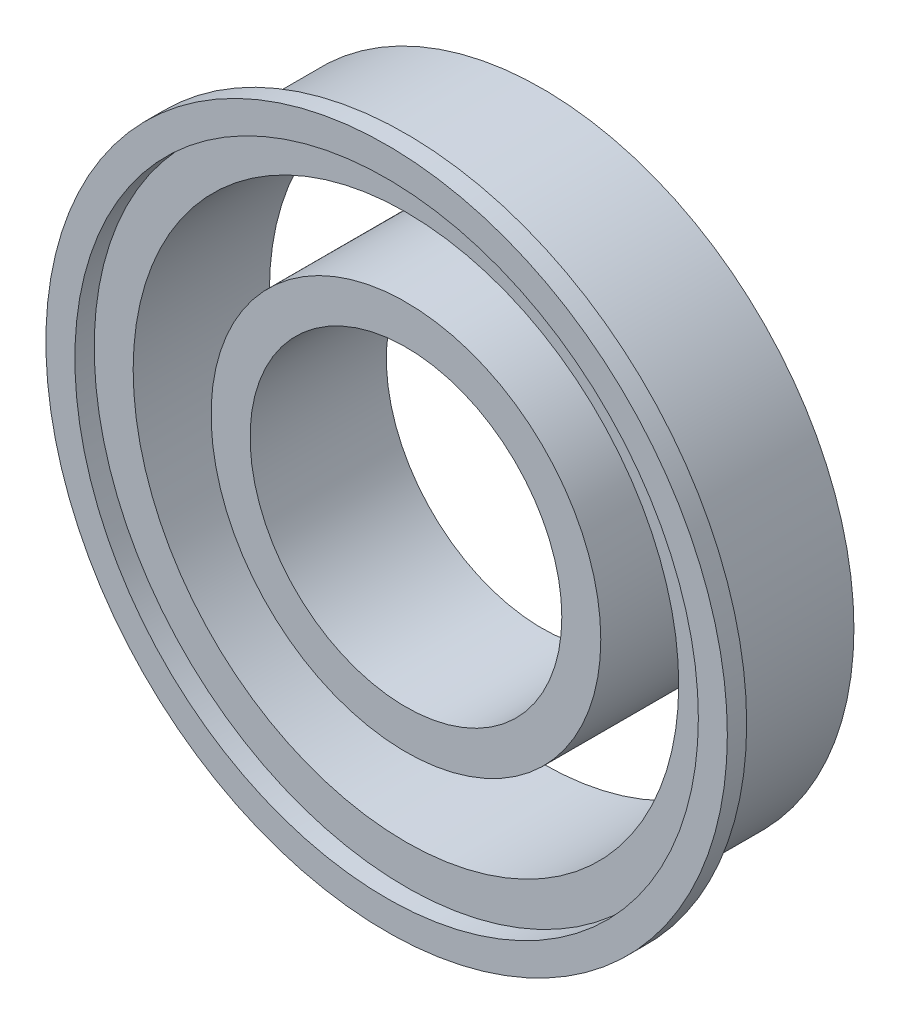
ISO-10303-21;
HEADER;
FILE_DESCRIPTION(('STEP AP214'),'2;1');
FILE_NAME('part.step','',(''),(''),'','','');
FILE_SCHEMA(('AUTOMOTIVE_DESIGN { 1 0 10303 214 1 1 1 1 }'));
ENDSEC;
DATA;
#1=APPLICATION_CONTEXT('core data for automotive mechanical design processes');
#2=APPLICATION_PROTOCOL_DEFINITION('international standard','automotive_design',2000,#1);
#3=PRODUCT_CONTEXT('',#1,'mechanical');
#4=PRODUCT('Part','Part','',(#3));
#5=PRODUCT_RELATED_PRODUCT_CATEGORY('part','',(#4));
#6=PRODUCT_DEFINITION_FORMATION('','',#4);
#7=PRODUCT_DEFINITION_CONTEXT('part definition',#1,'design');
#8=PRODUCT_DEFINITION('design','',#6,#7);
#9=PRODUCT_DEFINITION_SHAPE('','',#8);
#10=(LENGTH_UNIT() NAMED_UNIT(*) SI_UNIT(.MILLI.,.METRE.));
#11=(NAMED_UNIT(*) PLANE_ANGLE_UNIT() SI_UNIT($,.RADIAN.));
#12=(NAMED_UNIT(*) SI_UNIT($,.STERADIAN.) SOLID_ANGLE_UNIT());
#13=UNCERTAINTY_MEASURE_WITH_UNIT(LENGTH_MEASURE(1.E-05),#10,'distance_accuracy_value','');
#14=(GEOMETRIC_REPRESENTATION_CONTEXT(3) GLOBAL_UNCERTAINTY_ASSIGNED_CONTEXT((#13)) GLOBAL_UNIT_ASSIGNED_CONTEXT((#10,
#11,#12)) REPRESENTATION_CONTEXT('',''));
#15=CARTESIAN_POINT('',(0.,0.,0.));
#16=DIRECTION('',(0.,0.,1.));
#17=DIRECTION('',(1.,0.,0.));
#18=AXIS2_PLACEMENT_3D('',#15,#16,#17);
#19=CARTESIAN_POINT('',(0.,0.,7.1247));
#20=DIRECTION('',(0.,0.,1.));
#21=DIRECTION('',(1.,0.,0.));
#22=AXIS2_PLACEMENT_3D('',#19,#20,#21);
#23=PLANE('',#22);
#24=CARTESIAN_POINT('',(0.,0.,7.1247));
#25=DIRECTION('',(0.,0.,1.));
#26=DIRECTION('',(1.,0.,0.));
#27=AXIS2_PLACEMENT_3D('',#24,#25,#26);
#28=CIRCLE('',#27,27.761380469);
#29=CARTESIAN_POINT('',(27.761380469,0.,7.1247));
#30=VERTEX_POINT('',#29);
#31=EDGE_CURVE('E12',#30,#30,#28,.T.);
#32=ORIENTED_EDGE('',*,*,#31,.T.);
#33=EDGE_LOOP('',(#32));
#34=FACE_BOUND('',#33,.T.);
#35=CARTESIAN_POINT('',(0.,0.,7.1247));
#36=DIRECTION('',(0.,0.,1.));
#37=DIRECTION('',(1.,0.,0.));
#38=AXIS2_PLACEMENT_3D('',#35,#36,#37);
#39=CIRCLE('',#38,25.4);
#40=CARTESIAN_POINT('',(25.4,0.,7.1247));
#41=VERTEX_POINT('',#40);
#42=EDGE_CURVE('E58',#41,#41,#39,.T.);
#43=ORIENTED_EDGE('',*,*,#42,.F.);
#44=EDGE_LOOP('',(#43));
#45=FACE_BOUND('',#44,.T.);
#46=ADVANCED_FACE('F47',(#34,#45),#23,.T.);
#47=CARTESIAN_POINT('',(0.,0.,5.5499));
#48=DIRECTION('',(0.,0.,1.));
#49=DIRECTION('',(1.,0.,0.));
#50=AXIS2_PLACEMENT_3D('',#47,#48,#49);
#51=PLANE('',#50);
#52=CARTESIAN_POINT('',(0.,0.,5.5499));
#53=DIRECTION('',(0.,0.,1.));
#54=DIRECTION('',(1.,0.,0.));
#55=AXIS2_PLACEMENT_3D('',#52,#53,#54);
#56=CIRCLE('',#55,27.761380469);
#57=CARTESIAN_POINT('',(27.761380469,0.,5.5499));
#58=VERTEX_POINT('',#57);
#59=EDGE_CURVE('E54',#58,#58,#56,.T.);
#60=ORIENTED_EDGE('',*,*,#59,.F.);
#61=EDGE_LOOP('',(#60));
#62=FACE_BOUND('',#61,.T.);
#63=CARTESIAN_POINT('',(0.,0.,5.5499));
#64=DIRECTION('',(0.,0.,1.));
#65=DIRECTION('',(1.,0.,0.));
#66=AXIS2_PLACEMENT_3D('',#63,#64,#65);
#67=CIRCLE('',#66,25.4);
#68=CARTESIAN_POINT('',(25.4,0.,5.5499));
#69=VERTEX_POINT('',#68);
#70=EDGE_CURVE('E62',#69,#69,#67,.T.);
#71=ORIENTED_EDGE('',*,*,#70,.T.);
#72=EDGE_LOOP('',(#71));
#73=FACE_BOUND('',#72,.T.);
#74=ADVANCED_FACE('F68',(#62,#73),#51,.F.);
#75=CARTESIAN_POINT('',(0.,0.,7.1247));
#76=DIRECTION('',(0.,0.,-1.));
#77=DIRECTION('',(-1.,0.,0.));
#78=AXIS2_PLACEMENT_3D('',#75,#76,#77);
#79=CYLINDRICAL_SURFACE('',#78,27.761380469);
#80=ORIENTED_EDGE('',*,*,#31,.F.);
#81=EDGE_LOOP('',(#80));
#82=FACE_BOUND('',#81,.T.);
#83=ORIENTED_EDGE('',*,*,#59,.T.);
#84=EDGE_LOOP('',(#83));
#85=FACE_BOUND('',#84,.T.);
#86=ADVANCED_FACE('F49',(#82,#85),#79,.T.);
#87=CARTESIAN_POINT('',(0.,0.,7.1247));
#88=DIRECTION('',(0.,0.,-1.));
#89=DIRECTION('',(-1.,0.,0.));
#90=AXIS2_PLACEMENT_3D('',#87,#88,#89);
#91=CYLINDRICAL_SURFACE('',#90,25.4);
#92=ORIENTED_EDGE('',*,*,#42,.T.);
#93=EDGE_LOOP('',(#92));
#94=FACE_BOUND('',#93,.T.);
#95=ORIENTED_EDGE('',*,*,#70,.F.);
#96=EDGE_LOOP('',(#95));
#97=FACE_BOUND('',#96,.T.);
#98=ADVANCED_FACE('F70',(#94,#97),#91,.F.);
#99=CLOSED_SHELL('',(#46,#74,#86,#98));
#100=MANIFOLD_SOLID_BREP('B2',#99);
#101=CARTESIAN_POINT('',(0.,0.,5.5499));
#102=DIRECTION('',(0.,0.,-1.));
#103=DIRECTION('',(-1.,0.,0.));
#104=AXIS2_PLACEMENT_3D('',#101,#102,#103);
#105=CYLINDRICAL_SURFACE('',#104,12.7);
#106=CARTESIAN_POINT('',(0.,0.,5.5499));
#107=DIRECTION('',(0.,0.,1.));
#108=DIRECTION('',(1.,0.,0.));
#109=AXIS2_PLACEMENT_3D('',#106,#107,#108);
#110=CIRCLE('',#109,12.7);
#111=CARTESIAN_POINT('',(12.7,0.,5.5499));
#112=VERTEX_POINT('',#111);
#113=EDGE_CURVE('E121',#112,#112,#110,.T.);
#114=ORIENTED_EDGE('',*,*,#113,.T.);
#115=EDGE_LOOP('',(#114));
#116=FACE_BOUND('',#115,.T.);
#117=CARTESIAN_POINT('',(0.,0.,-5.5499));
#118=DIRECTION('',(0.,0.,1.));
#119=DIRECTION('',(1.,0.,0.));
#120=AXIS2_PLACEMENT_3D('',#117,#118,#119);
#121=CIRCLE('',#120,12.7);
#122=CARTESIAN_POINT('',(12.7,0.,-5.5499));
#123=VERTEX_POINT('',#122);
#124=EDGE_CURVE('E129',#123,#123,#121,.T.);
#125=ORIENTED_EDGE('',*,*,#124,.F.);
#126=EDGE_LOOP('',(#125));
#127=FACE_BOUND('',#126,.T.);
#128=ADVANCED_FACE('F115',(#116,#127),#105,.F.);
#129=CARTESIAN_POINT('',(0.,0.,5.5499));
#130=DIRECTION('',(0.,0.,-1.));
#131=DIRECTION('',(-1.,0.,0.));
#132=AXIS2_PLACEMENT_3D('',#129,#130,#131);
#133=CYLINDRICAL_SURFACE('',#132,15.875);
#134=CARTESIAN_POINT('',(0.,0.,5.5499));
#135=DIRECTION('',(0.,0.,1.));
#136=DIRECTION('',(1.,0.,0.));
#137=AXIS2_PLACEMENT_3D('',#134,#135,#136);
#138=CIRCLE('',#137,15.875);
#139=CARTESIAN_POINT('',(15.875,0.,5.5499));
#140=VERTEX_POINT('',#139);
#141=EDGE_CURVE('E46',#140,#140,#138,.T.);
#142=ORIENTED_EDGE('',*,*,#141,.F.);
#143=EDGE_LOOP('',(#142));
#144=FACE_BOUND('',#143,.T.);
#145=CARTESIAN_POINT('',(0.,0.,-5.5499));
#146=DIRECTION('',(0.,0.,1.));
#147=DIRECTION('',(1.,0.,0.));
#148=AXIS2_PLACEMENT_3D('',#145,#146,#147);
#149=CIRCLE('',#148,15.875);
#150=CARTESIAN_POINT('',(15.875,0.,-5.5499));
#151=VERTEX_POINT('',#150);
#152=EDGE_CURVE('E125',#151,#151,#149,.T.);
#153=ORIENTED_EDGE('',*,*,#152,.T.);
#154=EDGE_LOOP('',(#153));
#155=FACE_BOUND('',#154,.T.);
#156=ADVANCED_FACE('F139',(#144,#155),#133,.T.);
#157=CARTESIAN_POINT('',(0.,-56.0214213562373,5.5499));
#158=DIRECTION('',(0.,0.,1.));
#159=DIRECTION('',(1.,0.,0.));
#160=AXIS2_PLACEMENT_3D('',#157,#158,#159);
#161=PLANE('',#160);
#162=ORIENTED_EDGE('',*,*,#113,.F.);
#163=EDGE_LOOP('',(#162));
#164=FACE_BOUND('',#163,.T.);
#165=ORIENTED_EDGE('',*,*,#141,.T.);
#166=EDGE_LOOP('',(#165));
#167=FACE_BOUND('',#166,.T.);
#168=ADVANCED_FACE('F143',(#164,#167),#161,.T.);
#169=CARTESIAN_POINT('',(0.,-56.0214213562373,-5.5499));
#170=DIRECTION('',(0.,0.,1.));
#171=DIRECTION('',(1.,0.,0.));
#172=AXIS2_PLACEMENT_3D('',#169,#170,#171);
#173=PLANE('',#172);
#174=ORIENTED_EDGE('',*,*,#124,.T.);
#175=EDGE_LOOP('',(#174));
#176=FACE_BOUND('',#175,.T.);
#177=ORIENTED_EDGE('',*,*,#152,.F.);
#178=EDGE_LOOP('',(#177));
#179=FACE_BOUND('',#178,.T.);
#180=ADVANCED_FACE('F135',(#176,#179),#173,.F.);
#181=CLOSED_SHELL('',(#128,#156,#168,#180));
#182=MANIFOLD_SOLID_BREP('B7',#181);
#183=CARTESIAN_POINT('',(0.,0.,5.5499));
#184=DIRECTION('',(0.,0.,-1.));
#185=DIRECTION('',(-1.,0.,0.));
#186=AXIS2_PLACEMENT_3D('',#183,#184,#185);
#187=CYLINDRICAL_SURFACE('',#186,22.225);
#188=CARTESIAN_POINT('',(0.,0.,5.5499));
#189=DIRECTION('',(0.,0.,1.));
#190=DIRECTION('',(1.,0.,0.));
#191=AXIS2_PLACEMENT_3D('',#188,#189,#190);
#192=CIRCLE('',#191,22.225);
#193=CARTESIAN_POINT('',(22.225,0.,5.5499));
#194=VERTEX_POINT('',#193);
#195=EDGE_CURVE('E182',#194,#194,#192,.T.);
#196=ORIENTED_EDGE('',*,*,#195,.T.);
#197=EDGE_LOOP('',(#196));
#198=FACE_BOUND('',#197,.T.);
#199=CARTESIAN_POINT('',(0.,0.,-5.5499));
#200=DIRECTION('',(0.,0.,1.));
#201=DIRECTION('',(1.,0.,0.));
#202=AXIS2_PLACEMENT_3D('',#199,#200,#201);
#203=CIRCLE('',#202,22.225);
#204=CARTESIAN_POINT('',(22.225,0.,-5.5499));
#205=VERTEX_POINT('',#204);
#206=EDGE_CURVE('E190',#205,#205,#203,.T.);
#207=ORIENTED_EDGE('',*,*,#206,.F.);
#208=EDGE_LOOP('',(#207));
#209=FACE_BOUND('',#208,.T.);
#210=ADVANCED_FACE('F176',(#198,#209),#187,.F.);
#211=CARTESIAN_POINT('',(0.,0.,5.5499));
#212=DIRECTION('',(0.,0.,-1.));
#213=DIRECTION('',(-1.,0.,0.));
#214=AXIS2_PLACEMENT_3D('',#211,#212,#213);
#215=CYLINDRICAL_SURFACE('',#214,25.4);
#216=CARTESIAN_POINT('',(0.,0.,5.5499));
#217=DIRECTION('',(0.,0.,1.));
#218=DIRECTION('',(1.,0.,0.));
#219=AXIS2_PLACEMENT_3D('',#216,#217,#218);
#220=CIRCLE('',#219,25.4);
#221=CARTESIAN_POINT('',(25.4,0.,5.5499));
#222=VERTEX_POINT('',#221);
#223=EDGE_CURVE('E114',#222,#222,#220,.T.);
#224=ORIENTED_EDGE('',*,*,#223,.F.);
#225=EDGE_LOOP('',(#224));
#226=FACE_BOUND('',#225,.T.);
#227=CARTESIAN_POINT('',(0.,0.,-5.5499));
#228=DIRECTION('',(0.,0.,1.));
#229=DIRECTION('',(1.,0.,0.));
#230=AXIS2_PLACEMENT_3D('',#227,#228,#229);
#231=CIRCLE('',#230,25.4);
#232=CARTESIAN_POINT('',(25.4,0.,-5.5499));
#233=VERTEX_POINT('',#232);
#234=EDGE_CURVE('E186',#233,#233,#231,.T.);
#235=ORIENTED_EDGE('',*,*,#234,.T.);
#236=EDGE_LOOP('',(#235));
#237=FACE_BOUND('',#236,.T.);
#238=ADVANCED_FACE('F200',(#226,#237),#215,.T.);
#239=CARTESIAN_POINT('',(0.,-56.0214213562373,5.5499));
#240=DIRECTION('',(0.,0.,1.));
#241=DIRECTION('',(1.,0.,0.));
#242=AXIS2_PLACEMENT_3D('',#239,#240,#241);
#243=PLANE('',#242);
#244=ORIENTED_EDGE('',*,*,#195,.F.);
#245=EDGE_LOOP('',(#244));
#246=FACE_BOUND('',#245,.T.);
#247=ORIENTED_EDGE('',*,*,#223,.T.);
#248=EDGE_LOOP('',(#247));
#249=FACE_BOUND('',#248,.T.);
#250=ADVANCED_FACE('F204',(#246,#249),#243,.T.);
#251=CARTESIAN_POINT('',(0.,-56.0214213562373,-5.5499));
#252=DIRECTION('',(0.,0.,1.));
#253=DIRECTION('',(1.,0.,0.));
#254=AXIS2_PLACEMENT_3D('',#251,#252,#253);
#255=PLANE('',#254);
#256=ORIENTED_EDGE('',*,*,#206,.T.);
#257=EDGE_LOOP('',(#256));
#258=FACE_BOUND('',#257,.T.);
#259=ORIENTED_EDGE('',*,*,#234,.F.);
#260=EDGE_LOOP('',(#259));
#261=FACE_BOUND('',#260,.T.);
#262=ADVANCED_FACE('F196',(#258,#261),#255,.F.);
#263=CLOSED_SHELL('',(#210,#238,#250,#262));
#264=MANIFOLD_SOLID_BREP('B41',#263);
#265=ADVANCED_BREP_SHAPE_REPRESENTATION('',(#18,#100,#182,#264),#14);
#266=SHAPE_DEFINITION_REPRESENTATION(#9,#265);
ENDSEC;
END-ISO-10303-21;
